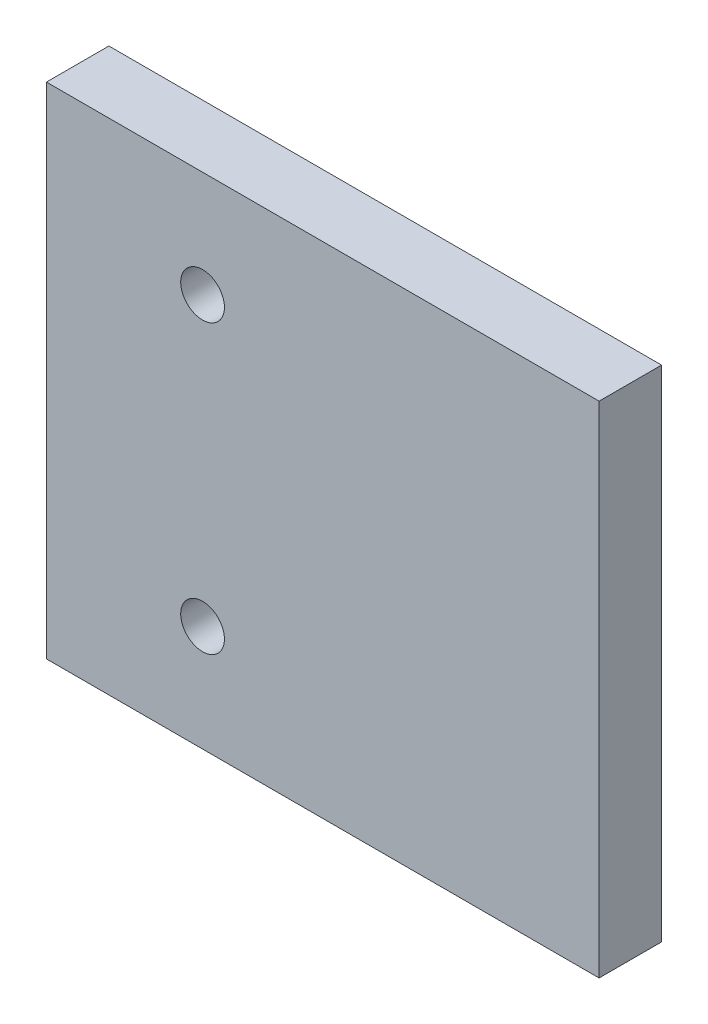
from build123d import *

# Parameters (mm, degrees)
ESQUISSE1_W      = 88.5
ESQUISSE1_H      = 80
ESQUISSE1_R      = 3.5
EXTRUSION1_DEPTH = 10


with BuildPart() as part:
    # Esquisse1 → Extrusion1 (new body)
    with BuildSketch(Plane.XY):
        with Locations((44.25, 40)):
            Rectangle(ESQUISSE1_W, ESQUISSE1_H)
        with Locations((25, 63)):
            Circle(ESQUISSE1_R, mode=Mode.SUBTRACT)
        with Locations((25, 17)):
            Circle(ESQUISSE1_R, mode=Mode.SUBTRACT)
    extrude(amount=EXTRUSION1_DEPTH)


solid = part.part
